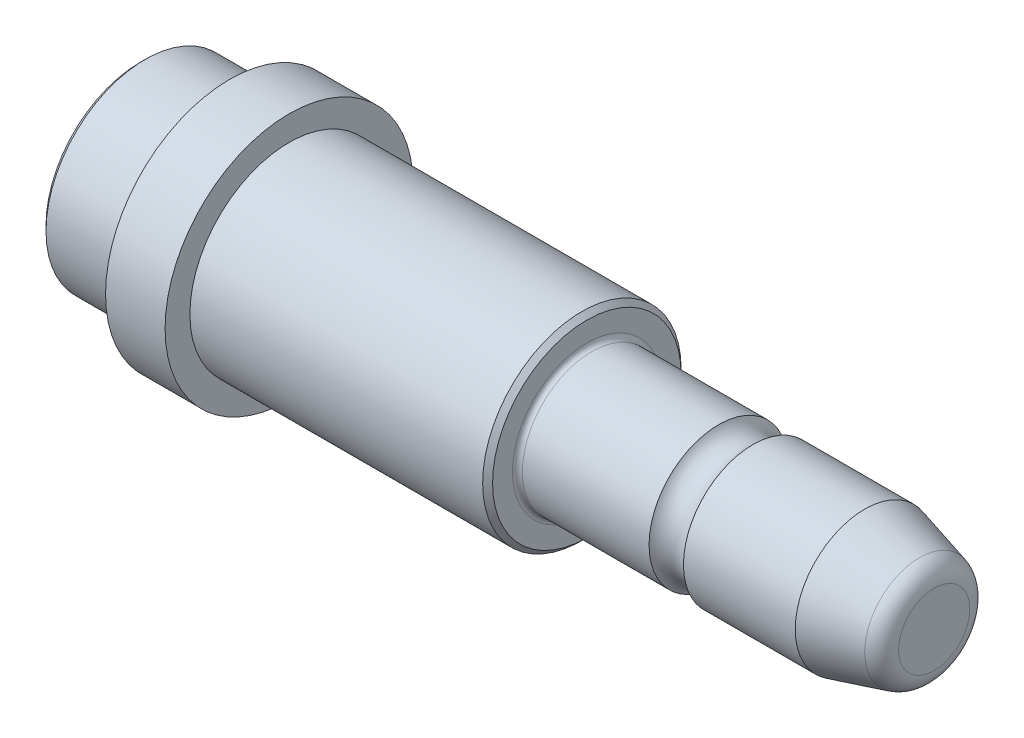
from build123d import *

# Parameters (mm, degrees)
CHANFREIN1_SIZE = 0.5
CONG_1_R        = 0.5
CONG_2_R        = 2


with BuildPart() as part:
    # Esquisse1 → Base-R_volution (revolve)
    with BuildSketch(Plane.XY, mode=Mode.PRIVATE) as base_r_volution_sk:
        with BuildLine():
            Line((9, 12.5), (15, 12.5))
            Line((15, 12.5), (15, 10))
            Line((15, 10), (45, 10))
            Line((45, 10), (45, 7))
            Line((45, 7), (58.267949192, 7))
            ThreePointArc((58.267949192, 7), (60, 6), (61.732050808, 7))
            Line((61.732050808, 7), (73, 7))
            Line((73, 7), (80, 5.124355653))
            Line((80, 5.124355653), (80, 0))
            Line((80, 0), (0, 0))
            Line((0, 0), (0, 10))
            Line((0, 10), (9, 10))
            Line((9, 10), (9, 12.5))
        make_face()
    revolve(base_r_volution_sk.sketch.rotate(Axis((-12.992566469, 0, 0), (1, 0, 0)), 90), axis=Axis((-12.992566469, 0, 0), (1, 0, 0)))

    # Chanfrein1
    chanfrein1_edges = [part.edges().sort_by_distance(p)[0] for p in [
        (0, 0, -10),
        (45, 0, -10),
    ]]
    chamfer(chanfrein1_edges, length=CHANFREIN1_SIZE)

    # Cong_1
    cong_1_edges = [part.edges().sort_by_distance(p)[0] for p in [
        (45, 0, -7),
    ]]
    fillet(cong_1_edges, radius=CONG_1_R)

    # Cong_2
    cong_2_edges = [part.edges().sort_by_distance(p)[0] for p in [
        (80, 0, -5.124355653),
    ]]
    fillet(cong_2_edges, radius=CONG_2_R)


solid = part.part
